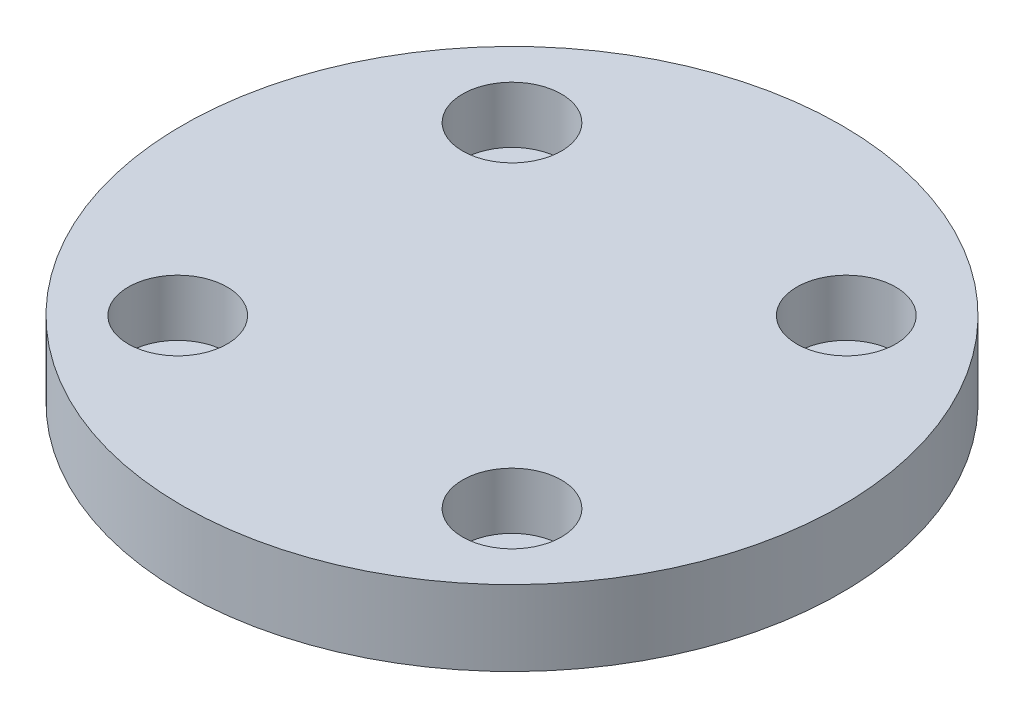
ISO-10303-21;
HEADER;
FILE_DESCRIPTION(('STEP AP214'),'2;1');
FILE_NAME('part.step','',(''),(''),'','','');
FILE_SCHEMA(('AUTOMOTIVE_DESIGN { 1 0 10303 214 1 1 1 1 }'));
ENDSEC;
DATA;
#1=APPLICATION_CONTEXT('core data for automotive mechanical design processes');
#2=APPLICATION_PROTOCOL_DEFINITION('international standard','automotive_design',2000,#1);
#3=PRODUCT_CONTEXT('',#1,'mechanical');
#4=PRODUCT('Part','Part','',(#3));
#5=PRODUCT_RELATED_PRODUCT_CATEGORY('part','',(#4));
#6=PRODUCT_DEFINITION_FORMATION('','',#4);
#7=PRODUCT_DEFINITION_CONTEXT('part definition',#1,'design');
#8=PRODUCT_DEFINITION('design','',#6,#7);
#9=PRODUCT_DEFINITION_SHAPE('','',#8);
#10=(LENGTH_UNIT() NAMED_UNIT(*) SI_UNIT(.MILLI.,.METRE.));
#11=(NAMED_UNIT(*) PLANE_ANGLE_UNIT() SI_UNIT($,.RADIAN.));
#12=(NAMED_UNIT(*) SI_UNIT($,.STERADIAN.) SOLID_ANGLE_UNIT());
#13=UNCERTAINTY_MEASURE_WITH_UNIT(LENGTH_MEASURE(1.E-05),#10,'distance_accuracy_value','');
#14=(GEOMETRIC_REPRESENTATION_CONTEXT(3) GLOBAL_UNCERTAINTY_ASSIGNED_CONTEXT((#13)) GLOBAL_UNIT_ASSIGNED_CONTEXT((#10,
#11,#12)) REPRESENTATION_CONTEXT('',''));
#15=CARTESIAN_POINT('',(0.,0.,0.));
#16=DIRECTION('',(0.,0.,1.));
#17=DIRECTION('',(1.,0.,0.));
#18=AXIS2_PLACEMENT_3D('',#15,#16,#17);
#19=CARTESIAN_POINT('',(0.,8.,0.));
#20=DIRECTION('',(0.,-1.,0.));
#21=DIRECTION('',(0.,0.,-1.));
#22=AXIS2_PLACEMENT_3D('',#19,#20,#21);
#23=CYLINDRICAL_SURFACE('',#22,35.);
#24=CARTESIAN_POINT('',(0.,8.,0.));
#25=DIRECTION('',(0.,1.,0.));
#26=DIRECTION('',(0.,0.,1.));
#27=AXIS2_PLACEMENT_3D('',#24,#25,#26);
#28=CIRCLE('',#27,35.);
#29=CARTESIAN_POINT('',(0.,8.,35.));
#30=VERTEX_POINT('',#29);
#31=EDGE_CURVE('E10',#30,#30,#28,.T.);
#32=ORIENTED_EDGE('',*,*,#31,.F.);
#33=EDGE_LOOP('',(#32));
#34=FACE_BOUND('',#33,.T.);
#35=CARTESIAN_POINT('',(0.,0.,0.));
#36=DIRECTION('',(0.,1.,0.));
#37=DIRECTION('',(0.,0.,1.));
#38=AXIS2_PLACEMENT_3D('',#35,#36,#37);
#39=CIRCLE('',#38,35.);
#40=CARTESIAN_POINT('',(0.,0.,35.));
#41=VERTEX_POINT('',#40);
#42=EDGE_CURVE('E33',#41,#41,#39,.T.);
#43=ORIENTED_EDGE('',*,*,#42,.T.);
#44=EDGE_LOOP('',(#43));
#45=FACE_BOUND('',#44,.T.);
#46=ADVANCED_FACE('F30',(#34,#45),#23,.T.);
#47=CARTESIAN_POINT('',(0.,8.,0.));
#48=DIRECTION('',(0.,1.,0.));
#49=DIRECTION('',(0.,0.,1.));
#50=AXIS2_PLACEMENT_3D('',#47,#48,#49);
#51=PLANE('',#50);
#52=CARTESIAN_POINT('',(-17.75,8.,17.75));
#53=DIRECTION('',(0.,1.,0.));
#54=DIRECTION('',(0.,0.,1.));
#55=AXIS2_PLACEMENT_3D('',#52,#53,#54);
#56=CIRCLE('',#55,5.25);
#57=CARTESIAN_POINT('',(-17.75,8.,23.));
#58=VERTEX_POINT('',#57);
#59=EDGE_CURVE('E60',#58,#58,#56,.T.);
#60=ORIENTED_EDGE('',*,*,#59,.F.);
#61=EDGE_LOOP('',(#60));
#62=FACE_BOUND('',#61,.T.);
#63=CARTESIAN_POINT('',(17.75,8.,17.75));
#64=DIRECTION('',(0.,1.,0.));
#65=DIRECTION('',(0.,0.,1.));
#66=AXIS2_PLACEMENT_3D('',#63,#64,#65);
#67=CIRCLE('',#66,5.25);
#68=CARTESIAN_POINT('',(17.75,8.,23.));
#69=VERTEX_POINT('',#68);
#70=EDGE_CURVE('E54',#69,#69,#67,.T.);
#71=ORIENTED_EDGE('',*,*,#70,.F.);
#72=EDGE_LOOP('',(#71));
#73=FACE_BOUND('',#72,.T.);
#74=CARTESIAN_POINT('',(17.75,8.,-17.75));
#75=DIRECTION('',(0.,1.,0.));
#76=DIRECTION('',(0.,0.,1.));
#77=AXIS2_PLACEMENT_3D('',#74,#75,#76);
#78=CIRCLE('',#77,5.25);
#79=CARTESIAN_POINT('',(17.75,8.,-12.5));
#80=VERTEX_POINT('',#79);
#81=EDGE_CURVE('E48',#80,#80,#78,.T.);
#82=ORIENTED_EDGE('',*,*,#81,.F.);
#83=EDGE_LOOP('',(#82));
#84=FACE_BOUND('',#83,.T.);
#85=CARTESIAN_POINT('',(-17.75,8.,-17.75));
#86=DIRECTION('',(0.,1.,0.));
#87=DIRECTION('',(0.,0.,1.));
#88=AXIS2_PLACEMENT_3D('',#85,#86,#87);
#89=CIRCLE('',#88,5.25);
#90=CARTESIAN_POINT('',(-17.75,8.,-12.5));
#91=VERTEX_POINT('',#90);
#92=EDGE_CURVE('E42',#91,#91,#89,.T.);
#93=ORIENTED_EDGE('',*,*,#92,.F.);
#94=EDGE_LOOP('',(#93));
#95=FACE_BOUND('',#94,.T.);
#96=ORIENTED_EDGE('',*,*,#31,.T.);
#97=EDGE_LOOP('',(#96));
#98=FACE_BOUND('',#97,.T.);
#99=ADVANCED_FACE('F114',(#62,#73,#84,#95,#98),#51,.T.);
#100=CARTESIAN_POINT('',(0.,0.,0.));
#101=DIRECTION('',(0.,1.,0.));
#102=DIRECTION('',(0.,0.,1.));
#103=AXIS2_PLACEMENT_3D('',#100,#101,#102);
#104=PLANE('',#103);
#105=CARTESIAN_POINT('',(17.75,0.,17.75));
#106=DIRECTION('',(0.,1.,0.));
#107=DIRECTION('',(0.,0.,1.));
#108=AXIS2_PLACEMENT_3D('',#105,#106,#107);
#109=CIRCLE('',#108,3.25);
#110=CARTESIAN_POINT('',(17.75,0.,21.));
#111=VERTEX_POINT('',#110);
#112=EDGE_CURVE('E81',#111,#111,#109,.T.);
#113=ORIENTED_EDGE('',*,*,#112,.T.);
#114=EDGE_LOOP('',(#113));
#115=FACE_BOUND('',#114,.T.);
#116=CARTESIAN_POINT('',(-17.75,0.,17.75));
#117=DIRECTION('',(0.,1.,0.));
#118=DIRECTION('',(0.,0.,1.));
#119=AXIS2_PLACEMENT_3D('',#116,#117,#118);
#120=CIRCLE('',#119,3.25);
#121=CARTESIAN_POINT('',(-17.75,0.,21.));
#122=VERTEX_POINT('',#121);
#123=EDGE_CURVE('E75',#122,#122,#120,.T.);
#124=ORIENTED_EDGE('',*,*,#123,.T.);
#125=EDGE_LOOP('',(#124));
#126=FACE_BOUND('',#125,.T.);
#127=CARTESIAN_POINT('',(-17.75,0.,-17.75));
#128=DIRECTION('',(0.,1.,0.));
#129=DIRECTION('',(0.,0.,1.));
#130=AXIS2_PLACEMENT_3D('',#127,#128,#129);
#131=CIRCLE('',#130,3.25);
#132=CARTESIAN_POINT('',(-17.75,0.,-14.5));
#133=VERTEX_POINT('',#132);
#134=EDGE_CURVE('E69',#133,#133,#131,.T.);
#135=ORIENTED_EDGE('',*,*,#134,.T.);
#136=EDGE_LOOP('',(#135));
#137=FACE_BOUND('',#136,.T.);
#138=CARTESIAN_POINT('',(17.75,0.,-17.75));
#139=DIRECTION('',(0.,1.,0.));
#140=DIRECTION('',(0.,0.,1.));
#141=AXIS2_PLACEMENT_3D('',#138,#139,#140);
#142=CIRCLE('',#141,3.25);
#143=CARTESIAN_POINT('',(17.75,0.,-14.5));
#144=VERTEX_POINT('',#143);
#145=EDGE_CURVE('E63',#144,#144,#142,.T.);
#146=ORIENTED_EDGE('',*,*,#145,.T.);
#147=EDGE_LOOP('',(#146));
#148=FACE_BOUND('',#147,.T.);
#149=ORIENTED_EDGE('',*,*,#42,.F.);
#150=EDGE_LOOP('',(#149));
#151=FACE_BOUND('',#150,.T.);
#152=ADVANCED_FACE('F90',(#115,#126,#137,#148,#151),#104,.F.);
#153=CARTESIAN_POINT('',(-17.75,2.,-17.75));
#154=DIRECTION('',(0.,1.,0.));
#155=DIRECTION('',(0.,0.,1.));
#156=AXIS2_PLACEMENT_3D('',#153,#154,#155);
#157=CYLINDRICAL_SURFACE('',#156,5.25);
#158=CARTESIAN_POINT('',(-17.75,2.,-17.75));
#159=DIRECTION('',(0.,1.,0.));
#160=DIRECTION('',(0.,0.,1.));
#161=AXIS2_PLACEMENT_3D('',#158,#159,#160);
#162=CIRCLE('',#161,5.25);
#163=CARTESIAN_POINT('',(-17.75,2.,-12.5));
#164=VERTEX_POINT('',#163);
#165=EDGE_CURVE('E40',#164,#164,#162,.T.);
#166=ORIENTED_EDGE('',*,*,#165,.F.);
#167=EDGE_LOOP('',(#166));
#168=FACE_BOUND('',#167,.T.);
#169=ORIENTED_EDGE('',*,*,#92,.T.);
#170=EDGE_LOOP('',(#169));
#171=FACE_BOUND('',#170,.T.);
#172=ADVANCED_FACE('F123',(#168,#171),#157,.F.);
#173=CARTESIAN_POINT('',(-17.75,2.,-17.75));
#174=DIRECTION('',(0.,1.,0.));
#175=DIRECTION('',(0.,0.,1.));
#176=AXIS2_PLACEMENT_3D('',#173,#174,#175);
#177=PLANE('',#176);
#178=CARTESIAN_POINT('',(-17.75,2.,-17.75));
#179=DIRECTION('',(0.,1.,0.));
#180=DIRECTION('',(0.,0.,1.));
#181=AXIS2_PLACEMENT_3D('',#178,#179,#180);
#182=CIRCLE('',#181,3.25);
#183=CARTESIAN_POINT('',(-17.75,2.,-14.5));
#184=VERTEX_POINT('',#183);
#185=EDGE_CURVE('E72',#184,#184,#182,.T.);
#186=ORIENTED_EDGE('',*,*,#185,.F.);
#187=EDGE_LOOP('',(#186));
#188=FACE_BOUND('',#187,.T.);
#189=ORIENTED_EDGE('',*,*,#165,.T.);
#190=EDGE_LOOP('',(#189));
#191=FACE_BOUND('',#190,.T.);
#192=ADVANCED_FACE('F125',(#188,#191),#177,.T.);
#193=CARTESIAN_POINT('',(17.75,2.,-17.75));
#194=DIRECTION('',(0.,1.,0.));
#195=DIRECTION('',(0.,0.,1.));
#196=AXIS2_PLACEMENT_3D('',#193,#194,#195);
#197=CYLINDRICAL_SURFACE('',#196,5.25);
#198=CARTESIAN_POINT('',(17.75,2.,-17.75));
#199=DIRECTION('',(0.,1.,0.));
#200=DIRECTION('',(0.,0.,1.));
#201=AXIS2_PLACEMENT_3D('',#198,#199,#200);
#202=CIRCLE('',#201,5.25);
#203=CARTESIAN_POINT('',(17.75,2.,-12.5));
#204=VERTEX_POINT('',#203);
#205=EDGE_CURVE('E45',#204,#204,#202,.T.);
#206=ORIENTED_EDGE('',*,*,#205,.F.);
#207=EDGE_LOOP('',(#206));
#208=FACE_BOUND('',#207,.T.);
#209=ORIENTED_EDGE('',*,*,#81,.T.);
#210=EDGE_LOOP('',(#209));
#211=FACE_BOUND('',#210,.T.);
#212=ADVANCED_FACE('F132',(#208,#211),#197,.F.);
#213=CARTESIAN_POINT('',(17.75,2.,-17.75));
#214=DIRECTION('',(0.,1.,0.));
#215=DIRECTION('',(0.,0.,1.));
#216=AXIS2_PLACEMENT_3D('',#213,#214,#215);
#217=PLANE('',#216);
#218=CARTESIAN_POINT('',(17.75,2.,-17.75));
#219=DIRECTION('',(0.,1.,0.));
#220=DIRECTION('',(0.,0.,1.));
#221=AXIS2_PLACEMENT_3D('',#218,#219,#220);
#222=CIRCLE('',#221,3.25);
#223=CARTESIAN_POINT('',(17.75,2.,-14.5));
#224=VERTEX_POINT('',#223);
#225=EDGE_CURVE('E66',#224,#224,#222,.T.);
#226=ORIENTED_EDGE('',*,*,#225,.F.);
#227=EDGE_LOOP('',(#226));
#228=FACE_BOUND('',#227,.T.);
#229=ORIENTED_EDGE('',*,*,#205,.T.);
#230=EDGE_LOOP('',(#229));
#231=FACE_BOUND('',#230,.T.);
#232=ADVANCED_FACE('F110',(#228,#231),#217,.T.);
#233=CARTESIAN_POINT('',(17.75,2.,17.75));
#234=DIRECTION('',(0.,1.,0.));
#235=DIRECTION('',(0.,0.,1.));
#236=AXIS2_PLACEMENT_3D('',#233,#234,#235);
#237=CYLINDRICAL_SURFACE('',#236,5.25);
#238=CARTESIAN_POINT('',(17.75,2.,17.75));
#239=DIRECTION('',(0.,1.,0.));
#240=DIRECTION('',(0.,0.,1.));
#241=AXIS2_PLACEMENT_3D('',#238,#239,#240);
#242=CIRCLE('',#241,5.25);
#243=CARTESIAN_POINT('',(17.75,2.,23.));
#244=VERTEX_POINT('',#243);
#245=EDGE_CURVE('E51',#244,#244,#242,.T.);
#246=ORIENTED_EDGE('',*,*,#245,.F.);
#247=EDGE_LOOP('',(#246));
#248=FACE_BOUND('',#247,.T.);
#249=ORIENTED_EDGE('',*,*,#70,.T.);
#250=EDGE_LOOP('',(#249));
#251=FACE_BOUND('',#250,.T.);
#252=ADVANCED_FACE('F104',(#248,#251),#237,.F.);
#253=CARTESIAN_POINT('',(17.75,2.,17.75));
#254=DIRECTION('',(0.,1.,0.));
#255=DIRECTION('',(0.,0.,1.));
#256=AXIS2_PLACEMENT_3D('',#253,#254,#255);
#257=PLANE('',#256);
#258=CARTESIAN_POINT('',(17.75,2.,17.75));
#259=DIRECTION('',(0.,1.,0.));
#260=DIRECTION('',(0.,0.,1.));
#261=AXIS2_PLACEMENT_3D('',#258,#259,#260);
#262=CIRCLE('',#261,3.25);
#263=CARTESIAN_POINT('',(17.75,2.,21.));
#264=VERTEX_POINT('',#263);
#265=EDGE_CURVE('E84',#264,#264,#262,.T.);
#266=ORIENTED_EDGE('',*,*,#265,.F.);
#267=EDGE_LOOP('',(#266));
#268=FACE_BOUND('',#267,.T.);
#269=ORIENTED_EDGE('',*,*,#245,.T.);
#270=EDGE_LOOP('',(#269));
#271=FACE_BOUND('',#270,.T.);
#272=ADVANCED_FACE('F100',(#268,#271),#257,.T.);
#273=CARTESIAN_POINT('',(-17.75,2.,17.75));
#274=DIRECTION('',(0.,1.,0.));
#275=DIRECTION('',(0.,0.,1.));
#276=AXIS2_PLACEMENT_3D('',#273,#274,#275);
#277=CYLINDRICAL_SURFACE('',#276,5.25);
#278=CARTESIAN_POINT('',(-17.75,2.,17.75));
#279=DIRECTION('',(0.,1.,0.));
#280=DIRECTION('',(0.,0.,1.));
#281=AXIS2_PLACEMENT_3D('',#278,#279,#280);
#282=CIRCLE('',#281,5.25);
#283=CARTESIAN_POINT('',(-17.75,2.,23.));
#284=VERTEX_POINT('',#283);
#285=EDGE_CURVE('E57',#284,#284,#282,.T.);
#286=ORIENTED_EDGE('',*,*,#285,.F.);
#287=EDGE_LOOP('',(#286));
#288=FACE_BOUND('',#287,.T.);
#289=ORIENTED_EDGE('',*,*,#59,.T.);
#290=EDGE_LOOP('',(#289));
#291=FACE_BOUND('',#290,.T.);
#292=ADVANCED_FACE('F103',(#288,#291),#277,.F.);
#293=CARTESIAN_POINT('',(-17.75,2.,17.75));
#294=DIRECTION('',(0.,1.,0.));
#295=DIRECTION('',(0.,0.,1.));
#296=AXIS2_PLACEMENT_3D('',#293,#294,#295);
#297=PLANE('',#296);
#298=CARTESIAN_POINT('',(-17.75,2.,17.75));
#299=DIRECTION('',(0.,1.,0.));
#300=DIRECTION('',(0.,0.,1.));
#301=AXIS2_PLACEMENT_3D('',#298,#299,#300);
#302=CIRCLE('',#301,3.25);
#303=CARTESIAN_POINT('',(-17.75,2.,21.));
#304=VERTEX_POINT('',#303);
#305=EDGE_CURVE('E78',#304,#304,#302,.T.);
#306=ORIENTED_EDGE('',*,*,#305,.F.);
#307=EDGE_LOOP('',(#306));
#308=FACE_BOUND('',#307,.T.);
#309=ORIENTED_EDGE('',*,*,#285,.T.);
#310=EDGE_LOOP('',(#309));
#311=FACE_BOUND('',#310,.T.);
#312=ADVANCED_FACE('F186',(#308,#311),#297,.T.);
#313=CARTESIAN_POINT('',(17.75,0.,-17.75));
#314=DIRECTION('',(0.,1.,0.));
#315=DIRECTION('',(0.,0.,1.));
#316=AXIS2_PLACEMENT_3D('',#313,#314,#315);
#317=CYLINDRICAL_SURFACE('',#316,3.25);
#318=ORIENTED_EDGE('',*,*,#145,.F.);
#319=EDGE_LOOP('',(#318));
#320=FACE_BOUND('',#319,.T.);
#321=ORIENTED_EDGE('',*,*,#225,.T.);
#322=EDGE_LOOP('',(#321));
#323=FACE_BOUND('',#322,.T.);
#324=ADVANCED_FACE('F191',(#320,#323),#317,.F.);
#325=CARTESIAN_POINT('',(-17.75,0.,-17.75));
#326=DIRECTION('',(0.,1.,0.));
#327=DIRECTION('',(0.,0.,1.));
#328=AXIS2_PLACEMENT_3D('',#325,#326,#327);
#329=CYLINDRICAL_SURFACE('',#328,3.25);
#330=ORIENTED_EDGE('',*,*,#134,.F.);
#331=EDGE_LOOP('',(#330));
#332=FACE_BOUND('',#331,.T.);
#333=ORIENTED_EDGE('',*,*,#185,.T.);
#334=EDGE_LOOP('',(#333));
#335=FACE_BOUND('',#334,.T.);
#336=ADVANCED_FACE('F201',(#332,#335),#329,.F.);
#337=CARTESIAN_POINT('',(-17.75,0.,17.75));
#338=DIRECTION('',(0.,1.,0.));
#339=DIRECTION('',(0.,0.,1.));
#340=AXIS2_PLACEMENT_3D('',#337,#338,#339);
#341=CYLINDRICAL_SURFACE('',#340,3.25);
#342=ORIENTED_EDGE('',*,*,#123,.F.);
#343=EDGE_LOOP('',(#342));
#344=FACE_BOUND('',#343,.T.);
#345=ORIENTED_EDGE('',*,*,#305,.T.);
#346=EDGE_LOOP('',(#345));
#347=FACE_BOUND('',#346,.T.);
#348=ADVANCED_FACE('F96',(#344,#347),#341,.F.);
#349=CARTESIAN_POINT('',(17.75,0.,17.75));
#350=DIRECTION('',(0.,1.,0.));
#351=DIRECTION('',(0.,0.,1.));
#352=AXIS2_PLACEMENT_3D('',#349,#350,#351);
#353=CYLINDRICAL_SURFACE('',#352,3.25);
#354=ORIENTED_EDGE('',*,*,#112,.F.);
#355=EDGE_LOOP('',(#354));
#356=FACE_BOUND('',#355,.T.);
#357=ORIENTED_EDGE('',*,*,#265,.T.);
#358=EDGE_LOOP('',(#357));
#359=FACE_BOUND('',#358,.T.);
#360=ADVANCED_FACE('F93',(#356,#359),#353,.F.);
#361=CLOSED_SHELL('',(#46,#99,#152,#172,#192,#212,#232,#252,#272,#292,#312,#324,#336,#348,#360));
#362=MANIFOLD_SOLID_BREP('B2',#361);
#363=ADVANCED_BREP_SHAPE_REPRESENTATION('',(#18,#362),#14);
#364=SHAPE_DEFINITION_REPRESENTATION(#9,#363);
ENDSEC;
END-ISO-10303-21;
